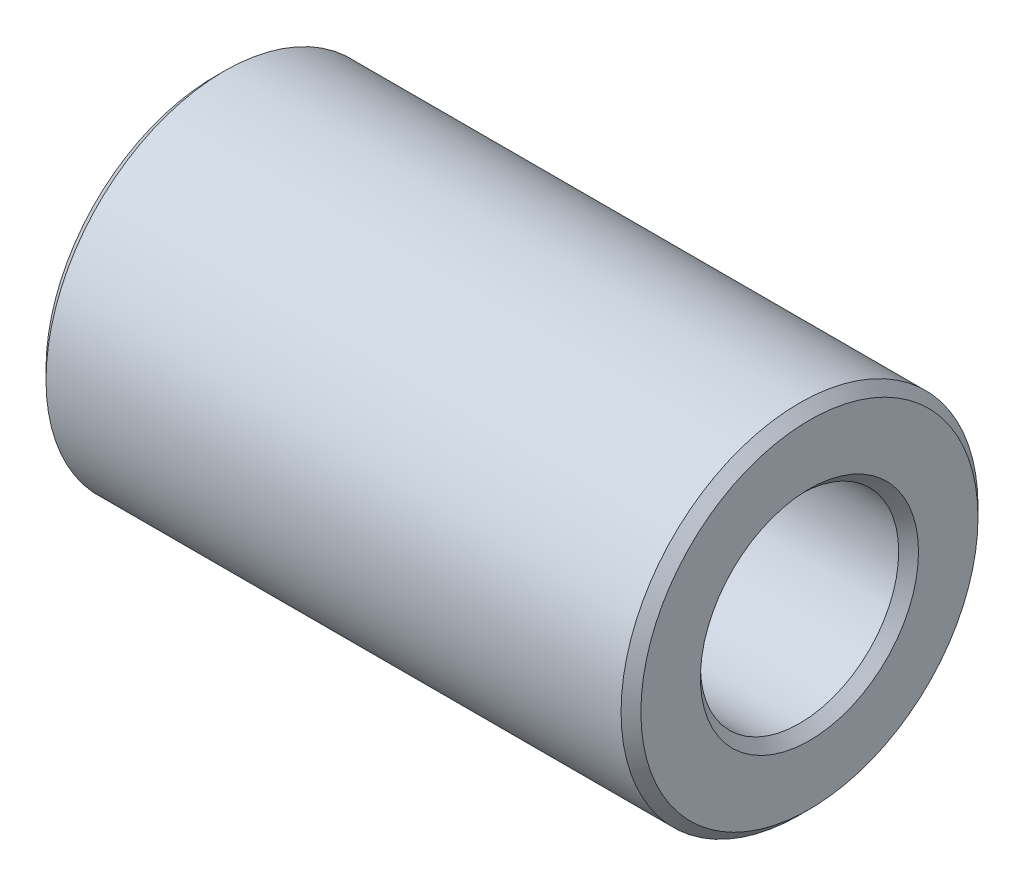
from build123d import *

# Parameters (mm, degrees)
ESQUISSE1_W     = 30
ESQUISSE1_H     = 4
CHANFREIN1_SIZE = 0.5


with BuildPart() as part:
    # Esquisse1 → Base-R_vol.-Mince (revolve)
    with BuildSketch(Plane.XY, mode=Mode.PRIVATE) as base_r_vol_mince_sk:
        with Locations((0, 7)):
            Rectangle(ESQUISSE1_W, ESQUISSE1_H)
    revolve(base_r_vol_mince_sk.sketch.rotate(Axis((0, 0, 0), (1, 0, 0)), 90), axis=Axis((0, 0, 0), (1, 0, 0)))

    # Chanfrein1
    chanfrein1_edges = [part.edges().sort_by_distance(p)[0] for p in [
        (15, 0, -5),
        (15, 0, -9),
        (-15, 0, -9),
        (-15, 0, -5),
    ]]
    chamfer(chanfrein1_edges, length=CHANFREIN1_SIZE)


solid = part.part
